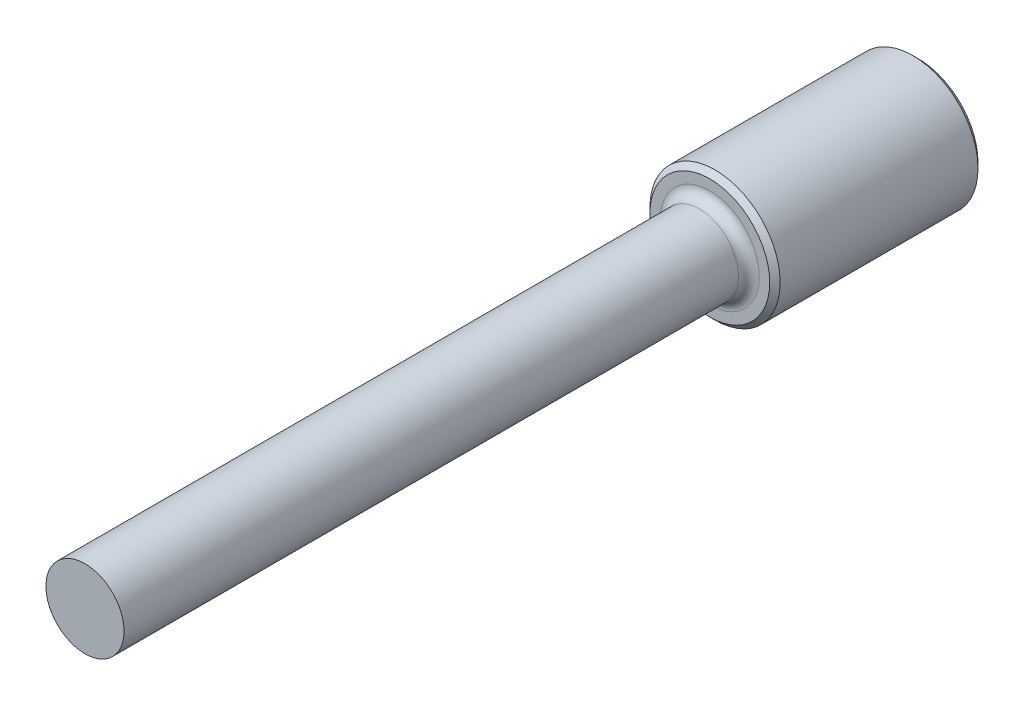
from build123d import *

# Parameters (mm, degrees)
ESQUISSE1_R           = 2.5
BOSS_EXTRU_1_DEPTH    = 8
ESQUISSE2_R           = 1.5
BOSS_EXTRU_2_DEPTH    = 24
TROU_TARAUD_M31_D     = 2.5
TROU_TARAUD_M31_DEPTH = 7.5
TROU_TARAUD_M31_TIP   = 0.751075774
CHANFREIN1_SIZE       = 0.2
CONG_1_R              = 0.4


with BuildPart() as part:
    # Esquisse1 → Boss.-Extru.1 (new body)
    with BuildSketch(Plane.XY):
        Circle(ESQUISSE1_R)
    extrude(amount=BOSS_EXTRU_1_DEPTH)

    # Esquisse2 → Boss.-Extru.2 (add)
    with BuildSketch(Plane.XY.offset(8)):
        Circle(ESQUISSE2_R)
    extrude(amount=BOSS_EXTRU_2_DEPTH)

    # Trou taraud_ M31
    with Locations(Plane(origin=(0, 0, 0), x_dir=(-1, 0, 0), z_dir=(0, 0, -1))):
        with Locations((0, 0)):
            Hole(TROU_TARAUD_M31_D / 2, depth=TROU_TARAUD_M31_DEPTH)
            with Locations((0, 0, -(TROU_TARAUD_M31_DEPTH + TROU_TARAUD_M31_TIP / 2))):  # 118° drill point
                Cone(0, TROU_TARAUD_M31_D / 2, TROU_TARAUD_M31_TIP, mode=Mode.SUBTRACT)

    # Chanfrein1
    chanfrein1_edges = [part.edges().sort_by_distance(p)[0] for p in [
        (-2.5, 0, 0),
        (-2.5, 0, 8),
    ]]
    chamfer(chanfrein1_edges, length=CHANFREIN1_SIZE)

    # Cong_1
    cong_1_edges = [part.edges().sort_by_distance(p)[0] for p in [
        (-1.5, 0, 8),
    ]]
    fillet(cong_1_edges, radius=CONG_1_R)


solid = part.part
